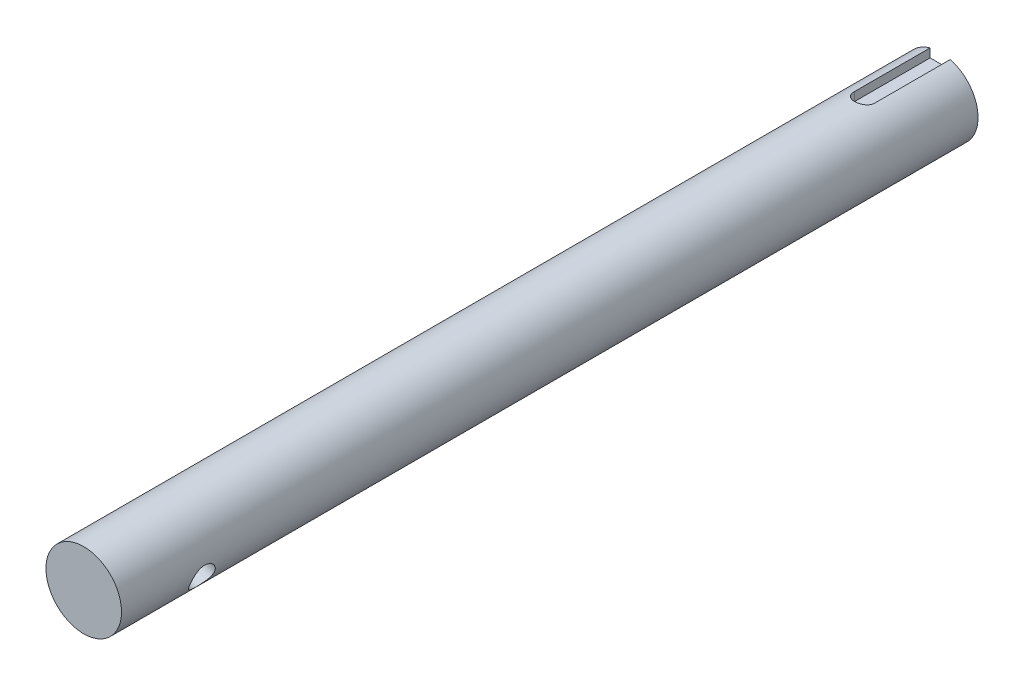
from build123d import *

# Parameters (mm, degrees)
ESQUISSE1_R                  = 15
BASE_EXTRUSION_DEPTH         = 340
ESQUISSE2_W                  = 30
ESQUISSE2_H                  = 4
ENL_V_MAT_EXTRU_1_DEPTH      = 4
ESQUISSE5_R                  = 4
ENL_V_MAT_EXTRU_2_DEPTH      = 342.322428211
M8X1_25_TROU_TARAUD_1_D      = 6.8
M8X1_25_TROU_TARAUD_1_DEPTH  = 26.25
M8X1_25_TROU_TARAUD_1_TIP    = 2.042926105
ENL_V_MAT_EXTRU_3_DEPTH      = 341.661122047
ENL_V_MAT_EXTRU_3_DEPTH_BACK = 341.661122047
ESQUISSE6_R                  = 5


with BuildPart() as part:
    # Esquisse1 → Base-Extrusion (new body)
    with BuildSketch(Plane.XY):
        Circle(ESQUISSE1_R)
    extrude(amount=BASE_EXTRUSION_DEPTH)

    # Esquisse2 → Enl_v. mat.-Extru.1 (cut, symmetric)
    with BuildSketch(Plane(origin=(0, 0, 0), x_dir=(0, 0, -1), z_dir=(1, 0, 0))):
        with Locations((-15, 13)):
            Rectangle(ESQUISSE2_W, ESQUISSE2_H)
    extrude(amount=ENL_V_MAT_EXTRU_1_DEPTH, both=True, mode=Mode.SUBTRACT)

    # Esquisse5 → Enl_v. mat.-Extru.2 (cut, through all)
    with BuildSketch(Plane(origin=(0, 11, 0), x_dir=(-1, 0, 0), z_dir=(0, 1, 0))):
        with Locations((0, 30)):
            Circle(ESQUISSE5_R)
    extrude(amount=ENL_V_MAT_EXTRU_2_DEPTH, mode=Mode.SUBTRACT)

    # M8x1.25 Trou taraud_1
    with Locations(Plane(origin=(0, 0, 0), x_dir=(-1, 0, 0), z_dir=(0, 0, -1))):
        with Locations((0, 0)):
            Hole(M8X1_25_TROU_TARAUD_1_D / 2, depth=M8X1_25_TROU_TARAUD_1_DEPTH)
            with Locations((0, 0, -(M8X1_25_TROU_TARAUD_1_DEPTH + M8X1_25_TROU_TARAUD_1_TIP / 2))):  # 118° drill point
                Cone(0, M8X1_25_TROU_TARAUD_1_D / 2, M8X1_25_TROU_TARAUD_1_TIP, mode=Mode.SUBTRACT)

    # Esquisse6 → Enl_v. mat.-Extru.3 (cut, two sides: drawn at the far end of the back side and taken through both)
    with BuildSketch(Plane(origin=(0, 0, 0), x_dir=(0, 0, -1), z_dir=(0.9335804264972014, -0.358367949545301, 0)).offset(-ENL_V_MAT_EXTRU_3_DEPTH_BACK)):
        with Locations(Location((-307, 0, 0), (0, 0, 90))):
            Circle(ESQUISSE6_R)
    extrude(amount=ENL_V_MAT_EXTRU_3_DEPTH + ENL_V_MAT_EXTRU_3_DEPTH_BACK, mode=Mode.SUBTRACT)


solid = part.part
